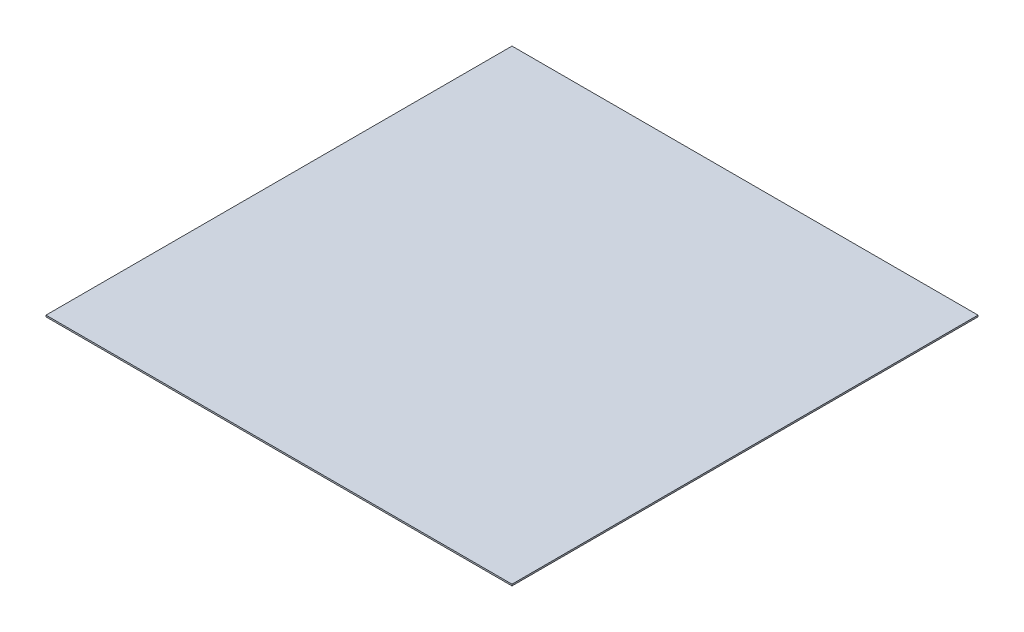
from build123d import *

# Parameters (mm, degrees)
SKETCH1_W           = 300
SKETCH1_H           = 300
BOSS_EXTRUDE1_DEPTH = 1


with BuildPart() as part:
    # Sketch1 → Boss-Extrude1 (new body)
    with BuildSketch(Plane(origin=(0, 0, 0), x_dir=(1, 0, 0), z_dir=(0, 1, 0))):
        Rectangle(SKETCH1_W, SKETCH1_H)
    extrude(amount=BOSS_EXTRUDE1_DEPTH)


solid = part.part
